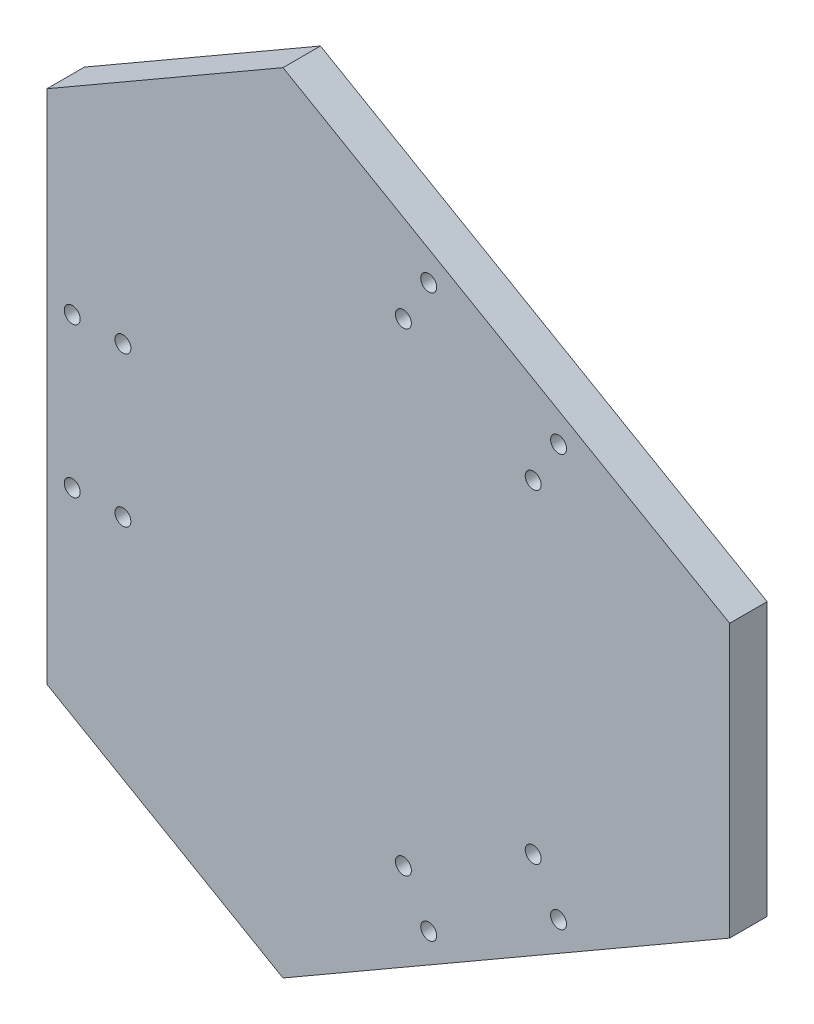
from build123d import *

# Parameters (mm, degrees)
BOSS_EXTRUDE1_DEPTH             = 6.35
TAP_DRILL_FOR_1_4_28_TAP1_D     = 5.4102
TAP_DRILL_FOR_1_4_28_TAP1_DEPTH = 12.7
TAP_DRILL_FOR_1_4_28_TAP1_TIP   = 1.625388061


with BuildPart() as part:
    # Sketch1 → Boss-Extrude1 (new, symmetric)
    with BuildSketch(Plane(origin=(0, 0, 0), x_dir=(0, 1, 0), z_dir=(0, 0, 1))):
        Polygon((-133.562982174, 23.779290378), (-87.374960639, 103.779290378), (87.374960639, 103.779290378), (133.562982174, 23.779290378), (46.188021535, -127.558580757), (-46.188021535, -127.558580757), align=None)
    extrude(amount=BOSS_EXTRUDE1_DEPTH, both=True)

    # Tap Drill for 1_4-28 Tap1
    with Locations(Plane.XY.offset(6.35)):
        with Locations((17.010037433, -80.262249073), (25.598412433, -95.137750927), (69.592502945, -69.737750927), (61.004127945, -54.862249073), (61.004127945, 54.862249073), (69.592502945, 69.737750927), (25.598412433, 95.137750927), (17.010037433, 80.262249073), (-78.014165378, 25.4), (-95.190915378, 25.4), (-95.190915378, -25.4), (-78.014165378, -25.4)):
            Hole(TAP_DRILL_FOR_1_4_28_TAP1_D / 2, depth=TAP_DRILL_FOR_1_4_28_TAP1_DEPTH)
            with Locations((0, 0, -(TAP_DRILL_FOR_1_4_28_TAP1_DEPTH + TAP_DRILL_FOR_1_4_28_TAP1_TIP / 2))):  # 118° drill point
                Cone(0, TAP_DRILL_FOR_1_4_28_TAP1_D / 2, TAP_DRILL_FOR_1_4_28_TAP1_TIP, mode=Mode.SUBTRACT)


solid = part.part
